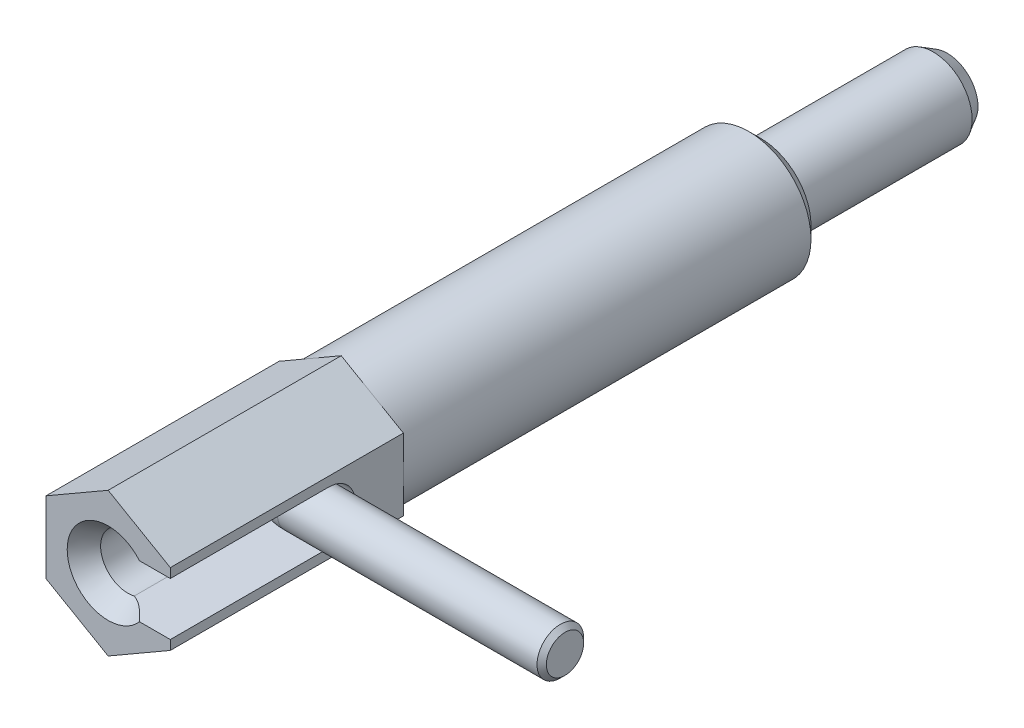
ISO-10303-21;
HEADER;
FILE_DESCRIPTION(('STEP AP214'),'2;1');
FILE_NAME('part.step','',(''),(''),'','','');
FILE_SCHEMA(('AUTOMOTIVE_DESIGN { 1 0 10303 214 1 1 1 1 }'));
ENDSEC;
DATA;
#1=APPLICATION_CONTEXT('core data for automotive mechanical design processes');
#2=APPLICATION_PROTOCOL_DEFINITION('international standard','automotive_design',2000,#1);
#3=PRODUCT_CONTEXT('',#1,'mechanical');
#4=PRODUCT('Part','Part','',(#3));
#5=PRODUCT_RELATED_PRODUCT_CATEGORY('part','',(#4));
#6=PRODUCT_DEFINITION_FORMATION('','',#4);
#7=PRODUCT_DEFINITION_CONTEXT('part definition',#1,'design');
#8=PRODUCT_DEFINITION('design','',#6,#7);
#9=PRODUCT_DEFINITION_SHAPE('','',#8);
#10=(LENGTH_UNIT() NAMED_UNIT(*) SI_UNIT(.MILLI.,.METRE.));
#11=(NAMED_UNIT(*) PLANE_ANGLE_UNIT() SI_UNIT($,.RADIAN.));
#12=(NAMED_UNIT(*) SI_UNIT($,.STERADIAN.) SOLID_ANGLE_UNIT());
#13=UNCERTAINTY_MEASURE_WITH_UNIT(LENGTH_MEASURE(1.E-05),#10,'distance_accuracy_value','');
#14=(GEOMETRIC_REPRESENTATION_CONTEXT(3) GLOBAL_UNCERTAINTY_ASSIGNED_CONTEXT((#13)) GLOBAL_UNIT_ASSIGNED_CONTEXT((#10,
#11,#12)) REPRESENTATION_CONTEXT('',''));
#15=CARTESIAN_POINT('',(0.,0.,0.));
#16=DIRECTION('',(0.,0.,1.));
#17=DIRECTION('',(1.,0.,0.));
#18=AXIS2_PLACEMENT_3D('',#15,#16,#17);
#19=CARTESIAN_POINT('',(19.2,0.,31.8));
#20=DIRECTION('',(-1.,0.,0.));
#21=DIRECTION('',(0.,0.,1.));
#22=AXIS2_PLACEMENT_3D('',#19,#20,#21);
#23=PLANE('',#22);
#24=CARTESIAN_POINT('',(19.2000000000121,0.,31.8));
#25=DIRECTION('',(-1.,0.,0.));
#26=DIRECTION('',(0.,0.,1.));
#27=AXIS2_PLACEMENT_3D('',#24,#25,#26);
#28=CIRCLE('',#27,1.19999999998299);
#29=CARTESIAN_POINT('',(19.2000000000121,0.,32.999999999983));
#30=VERTEX_POINT('',#29);
#31=EDGE_CURVE('E352',#30,#30,#28,.T.);
#32=ORIENTED_EDGE('',*,*,#31,.F.);
#33=EDGE_LOOP('',(#32));
#34=FACE_BOUND('',#33,.T.);
#35=ADVANCED_FACE('F14',(#34),#23,.F.);
#36=CARTESIAN_POINT('',(18.8999999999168,0.,31.8));
#37=DIRECTION('',(-1.,0.,0.));
#38=DIRECTION('',(0.,0.,1.));
#39=AXIS2_PLACEMENT_3D('',#36,#37,#38);
#40=CONICAL_SURFACE('',#39,1.50000000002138,0.78539816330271);
#41=ORIENTED_EDGE('',*,*,#31,.T.);
#42=EDGE_LOOP('',(#41));
#43=FACE_BOUND('',#42,.T.);
#44=CARTESIAN_POINT('',(18.9,0.,31.8));
#45=DIRECTION('',(1.,0.,0.));
#46=DIRECTION('',(0.,0.,-1.));
#47=AXIS2_PLACEMENT_3D('',#44,#45,#46);
#48=CIRCLE('',#47,1.5);
#49=CARTESIAN_POINT('',(18.9,0.,30.3));
#50=VERTEX_POINT('',#49);
#51=EDGE_CURVE('E342',#50,#50,#48,.F.);
#52=ORIENTED_EDGE('',*,*,#51,.F.);
#53=EDGE_LOOP('',(#52));
#54=FACE_BOUND('',#53,.T.);
#55=ADVANCED_FACE('F496',(#43,#54),#40,.T.);
#56=CARTESIAN_POINT('',(2.2,0.,31.8));
#57=DIRECTION('',(1.,0.,0.));
#58=DIRECTION('',(0.,0.,-1.));
#59=AXIS2_PLACEMENT_3D('',#56,#57,#58);
#60=CYLINDRICAL_SURFACE('',#59,1.5);
#61=ORIENTED_EDGE('',*,*,#51,.T.);
#62=EDGE_LOOP('',(#61));
#63=FACE_BOUND('',#62,.T.);
#64=CARTESIAN_POINT('',(2.2,0.,31.8));
#65=DIRECTION('',(-1.,0.,0.));
#66=DIRECTION('',(0.,0.,1.));
#67=AXIS2_PLACEMENT_3D('',#64,#65,#66);
#68=CIRCLE('',#67,1.5);
#69=CARTESIAN_POINT('',(2.2,0.,33.3));
#70=VERTEX_POINT('',#69);
#71=EDGE_CURVE('E339',#70,#70,#68,.T.);
#72=ORIENTED_EDGE('',*,*,#71,.F.);
#73=EDGE_LOOP('',(#72));
#74=FACE_BOUND('',#73,.T.);
#75=ADVANCED_FACE('F332',(#63,#74),#60,.T.);
#76=CARTESIAN_POINT('',(2.2,0.,29.6));
#77=DIRECTION('',(0.,-1.,0.));
#78=DIRECTION('',(-1.,0.,0.));
#79=AXIS2_PLACEMENT_3D('',#76,#77,#78);
#80=TOROIDAL_SURFACE('',#79,2.2,1.5);
#81=CARTESIAN_POINT('',(1.75,0.,33.2725331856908));
#82=CARTESIAN_POINT('',(1.74999438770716,-0.066525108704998,33.2725276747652));
#83=CARTESIAN_POINT('',(1.74616774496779,-0.1331198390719,33.2675728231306));
#84=CARTESIAN_POINT('',(1.73122032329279,-0.264085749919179,33.2480674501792));
#85=CARTESIAN_POINT('',(1.72008775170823,-0.328453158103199,33.2335014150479));
#86=CARTESIAN_POINT('',(1.69163334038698,-0.452673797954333,33.1957821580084));
#87=CARTESIAN_POINT('',(1.67435024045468,-0.512552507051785,33.1726826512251));
#88=CARTESIAN_POINT('',(1.63491483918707,-0.627081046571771,33.1190379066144));
#89=CARTESIAN_POINT('',(1.61276146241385,-0.681729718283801,33.0884910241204));
#90=CARTESIAN_POINT('',(1.55609957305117,-0.804461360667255,33.0085910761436));
#91=CARTESIAN_POINT('',(1.52005360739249,-0.870025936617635,32.9564626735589));
#92=CARTESIAN_POINT('',(1.44463855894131,-0.990242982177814,32.8428485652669));
#93=CARTESIAN_POINT('',(1.4052625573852,-1.0448718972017,32.7813431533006));
#94=CARTESIAN_POINT('',(1.31304970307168,-1.15994213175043,32.6295788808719));
#95=CARTESIAN_POINT('',(1.26001104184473,-1.21646839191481,32.5364845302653));
#96=CARTESIAN_POINT('',(1.15856030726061,-1.31345505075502,32.3399230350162));
#97=CARTESIAN_POINT('',(1.11015386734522,-1.35389607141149,32.2364435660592));
#98=CARTESIAN_POINT('',(1.03239391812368,-1.41370400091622,32.0423606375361));
#99=CARTESIAN_POINT('',(1.0011658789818,-1.43566447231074,31.9533002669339));
#100=CARTESIAN_POINT('',(0.94925549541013,-1.47051108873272,31.770470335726));
#101=CARTESIAN_POINT('',(0.928544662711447,-1.48342178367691,31.6767142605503));
#102=CARTESIAN_POINT('',(0.907447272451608,-1.49637158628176,31.5202437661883));
#103=CARTESIAN_POINT('',(0.902442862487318,-1.49936149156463,31.4584073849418));
#104=CARTESIAN_POINT('',(0.900637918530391,-1.50045511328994,31.3345051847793));
#105=CARTESIAN_POINT('',(0.903826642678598,-1.49856522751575,31.2724397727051));
#106=CARTESIAN_POINT('',(0.915762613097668,-1.49127254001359,31.1802465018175));
#107=CARTESIAN_POINT('',(0.920993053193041,-1.48806182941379,31.1494632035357));
#108=CARTESIAN_POINT('',(0.933926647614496,-1.47998010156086,31.0886496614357));
#109=CARTESIAN_POINT('',(0.941628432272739,-1.47511000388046,31.0586190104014));
#110=CARTESIAN_POINT('',(0.959439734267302,-1.46358695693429,30.999651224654));
#111=CARTESIAN_POINT('',(0.969547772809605,-1.4569351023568,30.9707134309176));
#112=CARTESIAN_POINT('',(0.991965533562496,-1.44176556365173,30.9142234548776));
#113=CARTESIAN_POINT('',(1.00427506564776,-1.43324804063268,30.8866711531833));
#114=CARTESIAN_POINT('',(1.04000568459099,-1.4077096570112,30.8146080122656));
#115=CARTESIAN_POINT('',(1.06521040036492,-1.38888931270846,30.7715948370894));
#116=CARTESIAN_POINT('',(1.11908741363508,-1.34585803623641,30.690776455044));
#117=CARTESIAN_POINT('',(1.14776380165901,-1.32164071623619,30.6529775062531));
#118=CARTESIAN_POINT('',(1.21802499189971,-1.25775266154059,30.5687007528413));
#119=CARTESIAN_POINT('',(1.26029032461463,-1.21573567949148,30.5245699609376));
#120=CARTESIAN_POINT('',(1.34343795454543,-1.12319551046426,30.4447555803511));
#121=CARTESIAN_POINT('',(1.38431813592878,-1.07265995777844,30.4090844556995));
#122=CARTESIAN_POINT('',(1.46264058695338,-0.96322508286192,30.3442707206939));
#123=CARTESIAN_POINT('',(1.49999592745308,-0.904176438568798,30.3152757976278));
#124=CARTESIAN_POINT('',(1.56825139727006,-0.779824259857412,30.263930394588));
#125=CARTESIAN_POINT('',(1.59915233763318,-0.714521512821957,30.2415790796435));
#126=CARTESIAN_POINT('',(1.65670933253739,-0.56979148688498,30.2005849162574));
#127=CARTESIAN_POINT('',(1.68222871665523,-0.48964766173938,30.1828504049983));
#128=CARTESIAN_POINT('',(1.72159904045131,-0.325187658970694,30.1556319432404));
#129=CARTESIAN_POINT('',(1.73545037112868,-0.240871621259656,30.1461477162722));
#130=CARTESIAN_POINT('',(1.75047446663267,-0.072708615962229,30.1358638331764));
#131=CARTESIAN_POINT('',(1.75195350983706,0.011098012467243,30.1348543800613));
#132=CARTESIAN_POINT('',(1.74294808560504,0.17774805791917,30.1410133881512));
#133=CARTESIAN_POINT('',(1.73246509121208,0.260591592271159,30.1481808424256));
#134=CARTESIAN_POINT('',(1.70053172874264,0.420977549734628,30.1701719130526));
#135=CARTESIAN_POINT('',(1.67934748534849,0.49859911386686,30.1848098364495));
#136=CARTESIAN_POINT('',(1.62726592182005,0.64870545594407,30.2214493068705));
#137=CARTESIAN_POINT('',(1.59636337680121,0.721187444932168,30.2434548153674));
#138=CARTESIAN_POINT('',(1.52513682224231,0.861925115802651,30.2960527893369));
#139=CARTESIAN_POINT('',(1.48449295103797,0.929906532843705,30.3269461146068));
#140=CARTESIAN_POINT('',(1.39715751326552,1.05657040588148,30.3979573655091));
#141=CARTESIAN_POINT('',(1.3504690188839,1.11525755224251,30.4380706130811));
#142=CARTESIAN_POINT('',(1.26670549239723,1.20867926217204,30.518364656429));
#143=CARTESIAN_POINT('',(1.2300221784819,1.24577884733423,30.5562041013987));
#144=CARTESIAN_POINT('',(1.15831969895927,1.31270178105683,30.6391638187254));
#145=CARTESIAN_POINT('',(1.12329727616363,1.3425398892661,30.684269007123));
#146=CARTESIAN_POINT('',(1.06377512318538,1.38999694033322,30.7739145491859));
#147=CARTESIAN_POINT('',(1.03849498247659,1.40882459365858,30.8172895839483));
#148=CARTESIAN_POINT('',(0.993526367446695,1.44089280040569,30.9087405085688));
#149=CARTESIAN_POINT('',(0.973833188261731,1.45413805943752,30.9568123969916));
#150=CARTESIAN_POINT('',(0.941404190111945,1.4753441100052,31.0563208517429));
#151=CARTESIAN_POINT('',(0.928666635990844,1.48330621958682,31.1077565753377));
#152=CARTESIAN_POINT('',(0.910379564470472,1.49459724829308,31.2123887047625));
#153=CARTESIAN_POINT('',(0.904838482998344,1.4979207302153,31.2655871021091));
#154=CARTESIAN_POINT('',(0.899448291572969,1.50117184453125,31.3929536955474));
#155=CARTESIAN_POINT('',(0.902624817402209,1.49929173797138,31.467283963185));
#156=CARTESIAN_POINT('',(0.918823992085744,1.48940766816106,31.6144725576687));
#157=CARTESIAN_POINT('',(0.931873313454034,1.48138711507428,31.6873263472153));
#158=CARTESIAN_POINT('',(0.961293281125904,1.46241026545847,31.8135619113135));
#159=CARTESIAN_POINT('',(0.976156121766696,1.45259151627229,31.8674858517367));
#160=CARTESIAN_POINT('',(1.00921308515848,1.42982224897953,31.9736378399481));
#161=CARTESIAN_POINT('',(1.02740887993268,1.4168701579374,32.0258650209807));
#162=CARTESIAN_POINT('',(1.08585641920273,1.37323789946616,32.1798662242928));
#163=CARTESIAN_POINT('',(1.12994642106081,1.33779424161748,32.2788760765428));
#164=CARTESIAN_POINT('',(1.22511394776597,1.2513556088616,32.4717724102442));
#165=CARTESIAN_POINT('',(1.2763937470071,1.19981939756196,32.5653197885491));
#166=CARTESIAN_POINT('',(1.35353396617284,1.10995382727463,32.6966096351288));
#167=CARTESIAN_POINT('',(1.37925333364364,1.07795069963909,32.738822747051));
#168=CARTESIAN_POINT('',(1.43013765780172,1.00946930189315,32.8199420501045));
#169=CARTESIAN_POINT('',(1.45530195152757,0.972985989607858,32.8588444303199));
#170=CARTESIAN_POINT('',(1.51199498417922,0.883181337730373,32.9444044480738));
#171=CARTESIAN_POINT('',(1.54303425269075,0.828174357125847,32.9896495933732));
#172=CARTESIAN_POINT('',(1.60071320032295,0.710283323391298,33.07178527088));
#173=CARTESIAN_POINT('',(1.62736260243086,0.647417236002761,33.1086943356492));
#174=CARTESIAN_POINT('',(1.67050699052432,0.524834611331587,33.1675040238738));
#175=CARTESIAN_POINT('',(1.6879358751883,0.466142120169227,33.1908446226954));
#176=CARTESIAN_POINT('',(1.71683271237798,0.344753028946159,33.2292153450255));
#177=CARTESIAN_POINT('',(1.72831245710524,0.282064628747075,33.2442619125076));
#178=CARTESIAN_POINT('',(1.74084964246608,0.182366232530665,33.260637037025));
#179=CARTESIAN_POINT('',(1.74426968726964,0.14613191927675,33.2650874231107));
#180=CARTESIAN_POINT('',(1.74884666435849,0.0732721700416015,33.271037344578));
#181=CARTESIAN_POINT('',(1.75000309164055,0.03664664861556,33.2725362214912));
#182=CARTESIAN_POINT('',(1.75,0.,33.2725331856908));
#183=B_SPLINE_CURVE_WITH_KNOTS('',3,(#81,#82,#83,#84,#85,#86,#87,#88,#89,#90,#91,#92,#93,#94,
#95,#96,#97,#98,#99,#100,#101,#102,#103,#104,#105,#106,#107,#108,#109,#110,#111,#112,#113,#114,
#115,#116,#117,#118,#119,#120,#121,#122,#123,#124,#125,#126,#127,#128,#129,#130,#131,#132,#133,
#134,#135,#136,#137,#138,#139,#140,#141,#142,#143,#144,#145,#146,#147,#148,#149,#150,#151,#152,
#153,#154,#155,#156,#157,#158,#159,#160,#161,#162,#163,#164,#165,#166,#167,#168,#169,#170,#171,
#172,#173,#174,#175,#176,#177,#178,#179,#180,#181,#182),.UNSPECIFIED.,.T.,.F.,(4,2,2,2,2,2,2,2,
2,2,2,2,2,2,2,2,2,2,2,2,2,2,2,2,2,2,2,2,2,2,2,2,2,2,2,2,2,2,2,2,2,2,2,2,2,2,2,2,2,2,4),(0.,
0.199414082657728,0.399150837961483,0.597651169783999,0.796195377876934,1.06825738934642,
1.34089924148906,1.702460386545,2.06445579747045,2.35431799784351,2.64339079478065,
2.82917777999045,3.01472130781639,3.10876120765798,3.20274907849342,3.2966793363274,
3.39060148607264,3.54969108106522,3.7089699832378,3.93023382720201,4.15182167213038,
4.37792049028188,4.60399088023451,4.86058869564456,5.1171779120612,5.36739581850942,
5.61758291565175,5.86183381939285,6.10621626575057,6.36010967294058,6.61387454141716,
6.80654417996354,6.99881886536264,7.15896104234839,7.31896795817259,7.47893494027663,
7.63908927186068,7.86111032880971,8.08373335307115,8.25388363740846,8.42411951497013,
8.76485080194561,9.11856876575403,9.29500756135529,9.47164677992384,9.70387786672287,
9.93558746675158,10.1313555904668,10.3267341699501,10.4365607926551,10.5464119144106),.UNSPECIFIED.);
#184=CARTESIAN_POINT('',(1.00617152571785,-1.43182361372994,30.8835496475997));
#185=VERTEX_POINT('',#184);
#186=CARTESIAN_POINT('',(1.6428928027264,-0.602829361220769,30.210472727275));
#187=VERTEX_POINT('',#186);
#188=EDGE_CURVE('E9',#185,#187,#183,.T.);
#189=ORIENTED_EDGE('',*,*,#188,.F.);
#190=CARTESIAN_POINT('',(0.393823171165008,1.49772263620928,30.9957444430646));
#191=CARTESIAN_POINT('',(0.421472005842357,1.49885509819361,30.9978571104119));
#192=CARTESIAN_POINT('',(0.449193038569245,1.49958407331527,30.9992207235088));
#193=CARTESIAN_POINT('',(0.504711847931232,1.50015047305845,31.000281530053));
#194=CARTESIAN_POINT('',(0.532509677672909,1.49998667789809,30.9999764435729));
#195=CARTESIAN_POINT('',(0.616053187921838,1.4980198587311,30.9962879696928));
#196=CARTESIAN_POINT('',(0.671697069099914,1.49472957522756,30.9901091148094));
#197=CARTESIAN_POINT('',(0.781392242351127,1.48324331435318,30.9692575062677));
#198=CARTESIAN_POINT('',(0.835426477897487,1.47500683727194,30.9545146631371));
#199=CARTESIAN_POINT('',(0.939055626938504,1.45274692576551,30.9168273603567));
#200=CARTESIAN_POINT('',(0.988667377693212,1.43874668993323,30.8939158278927));
#201=CARTESIAN_POINT('',(1.07717022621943,1.40636298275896,30.8445353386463));
#202=CARTESIAN_POINT('',(1.11663981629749,1.38858956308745,30.818687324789));
#203=CARTESIAN_POINT('',(1.19066124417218,1.34815475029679,30.7638313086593));
#204=CARTESIAN_POINT('',(1.22520109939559,1.32548177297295,30.7348158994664));
#205=CARTESIAN_POINT('',(1.30360414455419,1.26463395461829,30.6625552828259));
#206=CARTESIAN_POINT('',(1.34494303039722,1.22401516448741,30.6186340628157));
#207=CARTESIAN_POINT('',(1.41940355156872,1.13447269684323,30.5323792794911));
#208=CARTESIAN_POINT('',(1.45251508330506,1.08553893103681,30.4900477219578));
#209=CARTESIAN_POINT('',(1.51263424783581,0.979340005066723,30.4087899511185));
#210=CARTESIAN_POINT('',(1.5394849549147,0.921909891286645,30.36996376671));
#211=CARTESIAN_POINT('',(1.58704795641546,0.800851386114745,30.2988087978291));
#212=CARTESIAN_POINT('',(1.6077608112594,0.73722356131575,30.2664794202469));
#213=CARTESIAN_POINT('',(1.6461265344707,0.595349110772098,30.2055245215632));
#214=CARTESIAN_POINT('',(1.66288954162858,0.516325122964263,30.1781311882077));
#215=CARTESIAN_POINT('',(1.68902171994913,0.353947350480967,30.1351338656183));
#216=CARTESIAN_POINT('',(1.69839003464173,0.270593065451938,30.1195312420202));
#217=CARTESIAN_POINT('',(1.70947134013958,0.103035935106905,30.1010600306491));
#218=CARTESIAN_POINT('',(1.71127852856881,0.0188567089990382,30.0980347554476));
#219=CARTESIAN_POINT('',(1.70743701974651,-0.148839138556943,30.1044506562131));
#220=CARTESIAN_POINT('',(1.70178939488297,-0.232355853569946,30.1138900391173));
#221=CARTESIAN_POINT('',(1.68338951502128,-0.394603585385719,30.1444149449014));
#222=CARTESIAN_POINT('',(1.67078597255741,-0.473397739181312,30.1652566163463));
#223=CARTESIAN_POINT('',(1.63868368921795,-0.625977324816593,30.2173880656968));
#224=CARTESIAN_POINT('',(1.61918184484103,-0.699760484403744,30.2486825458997));
#225=CARTESIAN_POINT('',(1.57232480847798,-0.842463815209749,30.3212104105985));
#226=CARTESIAN_POINT('',(1.54476412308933,-0.911188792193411,30.3626986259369));
#227=CARTESIAN_POINT('',(1.49692912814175,-1.00735362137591,30.4300426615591));
#228=CARTESIAN_POINT('',(1.47989488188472,-1.03826415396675,30.4533514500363));
#229=CARTESIAN_POINT('',(1.44341187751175,-1.09757082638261,30.5012356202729));
#230=CARTESIAN_POINT('',(1.42396379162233,-1.12596766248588,30.5258106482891));
#231=CARTESIAN_POINT('',(1.37155994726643,-1.19406466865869,30.5886699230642));
#232=CARTESIAN_POINT('',(1.3368322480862,-1.23198230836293,30.6274497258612));
#233=CARTESIAN_POINT('',(1.26003509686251,-1.30060164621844,30.7040664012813));
#234=CARTESIAN_POINT('',(1.217979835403,-1.33131702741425,30.7419049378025));
#235=CARTESIAN_POINT('',(1.13472128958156,-1.37968774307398,30.8061390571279));
#236=CARTESIAN_POINT('',(1.09494283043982,-1.3987212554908,30.8333289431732));
#237=CARTESIAN_POINT('',(1.01042598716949,-1.43153662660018,30.882622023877));
#238=CARTESIAN_POINT('',(0.965696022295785,-1.44532722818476,30.9047336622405));
#239=CARTESIAN_POINT('',(0.872316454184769,-1.4679332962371,30.9422935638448));
#240=CARTESIAN_POINT('',(0.823664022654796,-1.47674513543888,30.9577369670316));
#241=CARTESIAN_POINT('',(0.723954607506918,-1.49001244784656,30.9814349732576));
#242=CARTESIAN_POINT('',(0.672891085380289,-1.49445526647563,30.9896686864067));
#243=CARTESIAN_POINT('',(0.583548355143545,-1.49899859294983,30.9981160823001));
#244=CARTESIAN_POINT('',(0.545434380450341,-1.49993318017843,30.9998683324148));
#245=CARTESIAN_POINT('',(0.469430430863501,-1.50005883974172,31.0001165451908));
#246=CARTESIAN_POINT('',(0.431540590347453,-1.49926107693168,30.9986333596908));
#247=CARTESIAN_POINT('',(0.393823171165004,-1.49772263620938,30.9957444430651));
#248=B_SPLINE_CURVE_WITH_KNOTS('',3,(#190,#191,#192,#193,#194,#195,#196,#197,#198,#199,#200,
#201,#202,#203,#204,#205,#206,#207,#208,#209,#210,#211,#212,#213,#214,#215,#216,#217,#218,#219,
#220,#221,#222,#223,#224,#225,#226,#227,#228,#229,#230,#231,#232,#233,#234,#235,#236,#237,#238,
#239,#240,#241,#242,#243,#244,#245,#246,#247),.UNSPECIFIED.,.F.,.F.,(4,2,2,2,2,2,2,2,2,2,2,2,2,
2,2,2,2,2,2,2,2,2,2,2,2,2,2,2,4),(0.,0.0832344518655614,0.166582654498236,0.334031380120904,
0.50287024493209,0.671036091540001,0.821648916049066,0.972621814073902,1.18958838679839,
1.40682010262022,1.62902022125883,1.8512000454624,2.10585684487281,2.36054313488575,
2.61204688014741,2.86351445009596,3.10980314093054,3.35620277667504,3.60953401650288,
3.73628614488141,3.86300305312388,4.0554857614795,4.24759976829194,4.40235288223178,
4.55684679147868,4.71145311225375,4.86650593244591,4.9808295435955,5.09441853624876),.UNSPECIFIED.);
#249=EDGE_CURVE('E313',#187,#185,#248,.T.);
#250=ORIENTED_EDGE('',*,*,#249,.F.);
#251=EDGE_LOOP('',(#189,#250));
#252=FACE_BOUND('',#251,.T.);
#253=CARTESIAN_POINT('',(0.,0.,29.6));
#254=DIRECTION('',(0.,0.,1.));
#255=DIRECTION('',(1.,0.,0.));
#256=AXIS2_PLACEMENT_3D('',#253,#254,#255);
#257=CIRCLE('',#256,1.5);
#258=CARTESIAN_POINT('',(1.49999999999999,0.,29.6));
#259=VERTEX_POINT('',#258);
#260=EDGE_CURVE('E249',#259,#259,#257,.F.);
#261=ORIENTED_EDGE('',*,*,#260,.F.);
#262=EDGE_LOOP('',(#261));
#263=FACE_BOUND('',#262,.T.);
#264=ORIENTED_EDGE('',*,*,#71,.T.);
#265=EDGE_LOOP('',(#264));
#266=FACE_BOUND('',#265,.T.);
#267=CARTESIAN_POINT('',(1.64289280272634,0.602829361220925,30.2104727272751));
#268=VERTEX_POINT('',#267);
#269=CARTESIAN_POINT('',(1.0061715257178,1.43182361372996,30.8835496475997));
#270=VERTEX_POINT('',#269);
#271=EDGE_CURVE('E27',#268,#270,#183,.T.);
#272=ORIENTED_EDGE('',*,*,#271,.F.);
#273=EDGE_CURVE('E321',#270,#268,#248,.T.);
#274=ORIENTED_EDGE('',*,*,#273,.F.);
#275=EDGE_LOOP('',(#272,#274));
#276=FACE_BOUND('',#275,.T.);
#277=ADVANCED_FACE('F325',(#252,#263,#266,#276),#80,.T.);
#278=CARTESIAN_POINT('',(0.,0.,-12.));
#279=DIRECTION('',(0.,0.,1.));
#280=DIRECTION('',(1.,0.,0.));
#281=AXIS2_PLACEMENT_3D('',#278,#279,#280);
#282=CYLINDRICAL_SURFACE('',#281,1.5);
#283=ORIENTED_EDGE('',*,*,#260,.T.);
#284=EDGE_LOOP('',(#283));
#285=FACE_BOUND('',#284,.T.);
#286=CARTESIAN_POINT('',(0.,0.,27.));
#287=DIRECTION('',(0.,0.,-1.));
#288=DIRECTION('',(-1.,0.,0.));
#289=AXIS2_PLACEMENT_3D('',#286,#287,#288);
#290=CIRCLE('',#289,1.5);
#291=CARTESIAN_POINT('',(-1.50000000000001,0.,27.));
#292=VERTEX_POINT('',#291);
#293=EDGE_CURVE('E653',#292,#292,#290,.T.);
#294=ORIENTED_EDGE('',*,*,#293,.F.);
#295=EDGE_LOOP('',(#294));
#296=FACE_BOUND('',#295,.T.);
#297=ADVANCED_FACE('F331',(#285,#296),#282,.T.);
#298=CARTESIAN_POINT('',(0.,-4.61880215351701,42.));
#299=DIRECTION('',(-0.5,-0.866025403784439,0.));
#300=DIRECTION('',(-0.866025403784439,0.5,0.));
#301=AXIS2_PLACEMENT_3D('',#298,#299,#300);
#302=PLANE('',#301);
#303=DIRECTION('',(0.,0.,1.));
#304=VECTOR('',#303,1.);
#305=CARTESIAN_POINT('',(-4.,-2.3094010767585,42.));
#306=LINE('',#305,#304);
#307=CARTESIAN_POINT('',(-4.,-2.3094010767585,27.));
#308=VERTEX_POINT('',#307);
#309=CARTESIAN_POINT('',(-4.,-2.3094010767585,42.));
#310=VERTEX_POINT('',#309);
#311=EDGE_CURVE('E191',#308,#310,#306,.T.);
#312=ORIENTED_EDGE('',*,*,#311,.F.);
#313=DIRECTION('',(-0.866025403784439,0.5,0.));
#314=VECTOR('',#313,1.);
#315=CARTESIAN_POINT('',(-2.,-3.46410161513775,27.));
#316=LINE('',#315,#314);
#317=CARTESIAN_POINT('',(-2.,-3.46410161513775,27.));
#318=VERTEX_POINT('',#317);
#319=EDGE_CURVE('E143',#318,#308,#316,.T.);
#320=ORIENTED_EDGE('',*,*,#319,.F.);
#321=DIRECTION('',(-0.866025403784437,0.5,0.));
#322=VECTOR('',#321,1.);
#323=CARTESIAN_POINT('',(0.,-4.61880215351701,27.));
#324=LINE('',#323,#322);
#325=CARTESIAN_POINT('',(0.,-4.61880215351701,27.));
#326=VERTEX_POINT('',#325);
#327=EDGE_CURVE('E172',#326,#318,#324,.T.);
#328=ORIENTED_EDGE('',*,*,#327,.F.);
#329=DIRECTION('',(0.,0.,-1.));
#330=VECTOR('',#329,1.);
#331=CARTESIAN_POINT('',(0.,-4.61880215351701,42.));
#332=LINE('',#331,#330);
#333=CARTESIAN_POINT('',(0.,-4.61880215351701,42.));
#334=VERTEX_POINT('',#333);
#335=EDGE_CURVE('E194',#326,#334,#332,.F.);
#336=ORIENTED_EDGE('',*,*,#335,.T.);
#337=DIRECTION('',(-0.866025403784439,0.5,0.));
#338=VECTOR('',#337,1.);
#339=CARTESIAN_POINT('',(0.,-4.61880215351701,42.));
#340=LINE('',#339,#338);
#341=EDGE_CURVE('E197',#334,#310,#340,.T.);
#342=ORIENTED_EDGE('',*,*,#341,.T.);
#343=EDGE_LOOP('',(#312,#320,#328,#336,#342));
#344=FACE_BOUND('',#343,.T.);
#345=ADVANCED_FACE('F375',(#344),#302,.T.);
#346=CARTESIAN_POINT('',(-4.,-2.3094010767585,42.));
#347=DIRECTION('',(-1.,0.,0.));
#348=DIRECTION('',(0.,0.,1.));
#349=AXIS2_PLACEMENT_3D('',#346,#347,#348);
#350=PLANE('',#349);
#351=DIRECTION('',(0.,0.,1.));
#352=VECTOR('',#351,1.);
#353=CARTESIAN_POINT('',(-4.,2.3094010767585,42.));
#354=LINE('',#353,#352);
#355=CARTESIAN_POINT('',(-4.,2.3094010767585,42.));
#356=VERTEX_POINT('',#355);
#357=CARTESIAN_POINT('',(-4.,2.3094010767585,27.));
#358=VERTEX_POINT('',#357);
#359=EDGE_CURVE('E133',#356,#358,#354,.F.);
#360=ORIENTED_EDGE('',*,*,#359,.T.);
#361=DIRECTION('',(0.,1.,0.));
#362=VECTOR('',#361,1.);
#363=CARTESIAN_POINT('',(-4.,0.,27.));
#364=LINE('',#363,#362);
#365=CARTESIAN_POINT('',(-4.,0.,27.));
#366=VERTEX_POINT('',#365);
#367=EDGE_CURVE('E142',#366,#358,#364,.T.);
#368=ORIENTED_EDGE('',*,*,#367,.F.);
#369=DIRECTION('',(0.,1.,0.));
#370=VECTOR('',#369,1.);
#371=CARTESIAN_POINT('',(-4.,0.,27.));
#372=LINE('',#371,#370);
#373=EDGE_CURVE('E167',#308,#366,#372,.T.);
#374=ORIENTED_EDGE('',*,*,#373,.F.);
#375=ORIENTED_EDGE('',*,*,#311,.T.);
#376=DIRECTION('',(0.,1.,0.));
#377=VECTOR('',#376,1.);
#378=CARTESIAN_POINT('',(-4.,-2.3094010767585,42.));
#379=LINE('',#378,#377);
#380=EDGE_CURVE('E151',#310,#356,#379,.T.);
#381=ORIENTED_EDGE('',*,*,#380,.T.);
#382=EDGE_LOOP('',(#360,#368,#374,#375,#381));
#383=FACE_BOUND('',#382,.T.);
#384=ADVANCED_FACE('F146',(#383),#350,.T.);
#385=CARTESIAN_POINT('',(-4.,2.3094010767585,42.));
#386=DIRECTION('',(-0.5,0.866025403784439,0.));
#387=DIRECTION('',(0.866025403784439,0.5,0.));
#388=AXIS2_PLACEMENT_3D('',#385,#386,#387);
#389=PLANE('',#388);
#390=DIRECTION('',(0.,0.,-1.));
#391=VECTOR('',#390,1.);
#392=CARTESIAN_POINT('',(0.,4.61880215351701,42.));
#393=LINE('',#392,#391);
#394=CARTESIAN_POINT('',(0.,4.61880215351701,42.));
#395=VERTEX_POINT('',#394);
#396=CARTESIAN_POINT('',(0.,4.61880215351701,27.));
#397=VERTEX_POINT('',#396);
#398=EDGE_CURVE('E193',#395,#397,#393,.T.);
#399=ORIENTED_EDGE('',*,*,#398,.T.);
#400=DIRECTION('',(0.866025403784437,0.5,0.));
#401=VECTOR('',#400,1.);
#402=CARTESIAN_POINT('',(-2.,3.46410161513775,27.));
#403=LINE('',#402,#401);
#404=CARTESIAN_POINT('',(-2.,3.46410161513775,27.));
#405=VERTEX_POINT('',#404);
#406=EDGE_CURVE('E136',#405,#397,#403,.T.);
#407=ORIENTED_EDGE('',*,*,#406,.F.);
#408=DIRECTION('',(0.866025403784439,0.5,0.));
#409=VECTOR('',#408,1.);
#410=CARTESIAN_POINT('',(-4.,2.3094010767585,27.));
#411=LINE('',#410,#409);
#412=EDGE_CURVE('E128',#358,#405,#411,.T.);
#413=ORIENTED_EDGE('',*,*,#412,.F.);
#414=ORIENTED_EDGE('',*,*,#359,.F.);
#415=DIRECTION('',(0.866025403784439,0.5,0.));
#416=VECTOR('',#415,1.);
#417=CARTESIAN_POINT('',(-4.,2.3094010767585,42.));
#418=LINE('',#417,#416);
#419=EDGE_CURVE('E215',#356,#395,#418,.T.);
#420=ORIENTED_EDGE('',*,*,#419,.T.);
#421=EDGE_LOOP('',(#399,#407,#413,#414,#420));
#422=FACE_BOUND('',#421,.T.);
#423=ADVANCED_FACE('F131',(#422),#389,.T.);
#424=CARTESIAN_POINT('',(0.,0.,27.));
#425=DIRECTION('',(0.,0.,-1.));
#426=DIRECTION('',(-1.,0.,0.));
#427=AXIS2_PLACEMENT_3D('',#424,#425,#426);
#428=PLANE('',#427);
#429=CARTESIAN_POINT('',(0.,0.,27.));
#430=DIRECTION('',(0.,0.,1.));
#431=DIRECTION('',(1.,0.,0.));
#432=AXIS2_PLACEMENT_3D('',#429,#430,#431);
#433=CIRCLE('',#432,4.);
#434=CARTESIAN_POINT('',(2.,-3.46410161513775,27.));
#435=VERTEX_POINT('',#434);
#436=EDGE_CURVE('E254',#435,#318,#433,.F.);
#437=ORIENTED_EDGE('',*,*,#436,.F.);
#438=DIRECTION('',(-0.866025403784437,-0.5,0.));
#439=VECTOR('',#438,1.);
#440=CARTESIAN_POINT('',(2.,-3.46410161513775,27.));
#441=LINE('',#440,#439);
#442=EDGE_CURVE('E169',#435,#326,#441,.T.);
#443=ORIENTED_EDGE('',*,*,#442,.T.);
#444=ORIENTED_EDGE('',*,*,#327,.T.);
#445=EDGE_LOOP('',(#437,#443,#444));
#446=FACE_BOUND('',#445,.T.);
#447=ADVANCED_FACE('F397',(#446),#428,.T.);
#448=CARTESIAN_POINT('',(0.,4.61880215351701,42.));
#449=DIRECTION('',(0.5,0.866025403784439,0.));
#450=DIRECTION('',(0.866025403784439,-0.5,0.));
#451=AXIS2_PLACEMENT_3D('',#448,#449,#450);
#452=PLANE('',#451);
#453=DIRECTION('',(0.,0.,-1.));
#454=VECTOR('',#453,1.);
#455=CARTESIAN_POINT('',(4.,2.3094010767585,42.));
#456=LINE('',#455,#454);
#457=CARTESIAN_POINT('',(4.,2.3094010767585,27.));
#458=VERTEX_POINT('',#457);
#459=CARTESIAN_POINT('',(4.,2.3094010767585,42.));
#460=VERTEX_POINT('',#459);
#461=EDGE_CURVE('E211',#458,#460,#456,.F.);
#462=ORIENTED_EDGE('',*,*,#461,.F.);
#463=DIRECTION('',(0.866025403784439,-0.5,0.));
#464=VECTOR('',#463,1.);
#465=CARTESIAN_POINT('',(2.,3.46410161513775,27.));
#466=LINE('',#465,#464);
#467=CARTESIAN_POINT('',(2.,3.46410161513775,27.));
#468=VERTEX_POINT('',#467);
#469=EDGE_CURVE('E181',#468,#458,#466,.T.);
#470=ORIENTED_EDGE('',*,*,#469,.F.);
#471=DIRECTION('',(0.866025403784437,-0.5,0.));
#472=VECTOR('',#471,1.);
#473=CARTESIAN_POINT('',(0.,4.61880215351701,27.));
#474=LINE('',#473,#472);
#475=EDGE_CURVE('E188',#397,#468,#474,.T.);
#476=ORIENTED_EDGE('',*,*,#475,.F.);
#477=ORIENTED_EDGE('',*,*,#398,.F.);
#478=DIRECTION('',(0.866025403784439,-0.5,0.));
#479=VECTOR('',#478,1.);
#480=CARTESIAN_POINT('',(0.,4.61880215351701,42.));
#481=LINE('',#480,#479);
#482=EDGE_CURVE('E220',#395,#460,#481,.T.);
#483=ORIENTED_EDGE('',*,*,#482,.T.);
#484=EDGE_LOOP('',(#462,#470,#476,#477,#483));
#485=FACE_BOUND('',#484,.T.);
#486=ADVANCED_FACE('F394',(#485),#452,.T.);
#487=CARTESIAN_POINT('',(0.,0.,27.));
#488=DIRECTION('',(0.,0.,-1.));
#489=DIRECTION('',(-1.,0.,0.));
#490=AXIS2_PLACEMENT_3D('',#487,#488,#489);
#491=PLANE('',#490);
#492=CARTESIAN_POINT('',(0.,0.,27.));
#493=DIRECTION('',(0.,0.,1.));
#494=DIRECTION('',(1.,0.,0.));
#495=AXIS2_PLACEMENT_3D('',#492,#493,#494);
#496=CIRCLE('',#495,4.);
#497=CARTESIAN_POINT('',(4.,0.,27.));
#498=VERTEX_POINT('',#497);
#499=EDGE_CURVE('E260',#468,#498,#496,.F.);
#500=ORIENTED_EDGE('',*,*,#499,.F.);
#501=ORIENTED_EDGE('',*,*,#469,.T.);
#502=DIRECTION('',(0.,1.,0.));
#503=VECTOR('',#502,1.);
#504=CARTESIAN_POINT('',(4.,0.,27.));
#505=LINE('',#504,#503);
#506=EDGE_CURVE('E184',#458,#498,#505,.F.);
#507=ORIENTED_EDGE('',*,*,#506,.T.);
#508=EDGE_LOOP('',(#500,#501,#507));
#509=FACE_BOUND('',#508,.T.);
#510=ADVANCED_FACE('F396',(#509),#491,.T.);
#511=CARTESIAN_POINT('',(0.,0.,27.));
#512=DIRECTION('',(0.,0.,-1.));
#513=DIRECTION('',(-1.,0.,0.));
#514=AXIS2_PLACEMENT_3D('',#511,#512,#513);
#515=PLANE('',#514);
#516=CARTESIAN_POINT('',(0.,0.,27.));
#517=DIRECTION('',(0.,0.,1.));
#518=DIRECTION('',(1.,0.,0.));
#519=AXIS2_PLACEMENT_3D('',#516,#517,#518);
#520=CIRCLE('',#519,4.);
#521=EDGE_CURVE('E257',#498,#435,#520,.F.);
#522=ORIENTED_EDGE('',*,*,#521,.F.);
#523=DIRECTION('',(0.,1.,0.));
#524=VECTOR('',#523,1.);
#525=CARTESIAN_POINT('',(4.,0.,27.));
#526=LINE('',#525,#524);
#527=CARTESIAN_POINT('',(4.,-2.3094010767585,27.));
#528=VERTEX_POINT('',#527);
#529=EDGE_CURVE('E175',#498,#528,#526,.F.);
#530=ORIENTED_EDGE('',*,*,#529,.T.);
#531=DIRECTION('',(-0.866025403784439,-0.5,0.));
#532=VECTOR('',#531,1.);
#533=CARTESIAN_POINT('',(4.,-2.3094010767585,27.));
#534=LINE('',#533,#532);
#535=EDGE_CURVE('E178',#528,#435,#534,.T.);
#536=ORIENTED_EDGE('',*,*,#535,.T.);
#537=EDGE_LOOP('',(#522,#530,#536));
#538=FACE_BOUND('',#537,.T.);
#539=ADVANCED_FACE('F389',(#538),#515,.T.);
#540=CARTESIAN_POINT('',(4.,-2.3094010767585,42.));
#541=DIRECTION('',(0.5,-0.866025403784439,0.));
#542=DIRECTION('',(-0.866025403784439,-0.5,0.));
#543=AXIS2_PLACEMENT_3D('',#540,#541,#542);
#544=PLANE('',#543);
#545=ORIENTED_EDGE('',*,*,#335,.F.);
#546=ORIENTED_EDGE('',*,*,#442,.F.);
#547=ORIENTED_EDGE('',*,*,#535,.F.);
#548=DIRECTION('',(0.,0.,-1.));
#549=VECTOR('',#548,1.);
#550=CARTESIAN_POINT('',(4.,-2.3094010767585,42.));
#551=LINE('',#550,#549);
#552=CARTESIAN_POINT('',(4.,-2.3094010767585,42.));
#553=VERTEX_POINT('',#552);
#554=EDGE_CURVE('E202',#528,#553,#551,.F.);
#555=ORIENTED_EDGE('',*,*,#554,.T.);
#556=DIRECTION('',(-0.866025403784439,-0.5,0.));
#557=VECTOR('',#556,1.);
#558=CARTESIAN_POINT('',(4.,-2.3094010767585,42.));
#559=LINE('',#558,#557);
#560=EDGE_CURVE('E198',#553,#334,#559,.T.);
#561=ORIENTED_EDGE('',*,*,#560,.T.);
#562=EDGE_LOOP('',(#545,#546,#547,#555,#561));
#563=FACE_BOUND('',#562,.T.);
#564=ADVANCED_FACE('F386',(#563),#544,.T.);
#565=CARTESIAN_POINT('',(0.,0.,42.));
#566=DIRECTION('',(0.,0.,-1.));
#567=DIRECTION('',(-1.,0.,0.));
#568=AXIS2_PLACEMENT_3D('',#565,#566,#567);
#569=PLANE('',#568);
#570=CARTESIAN_POINT('',(0.,0.,41.9999999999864));
#571=DIRECTION('',(0.,0.,1.));
#572=DIRECTION('',(1.,0.,0.));
#573=AXIS2_PLACEMENT_3D('',#570,#571,#572);
#574=CIRCLE('',#573,2.6357625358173);
#575=CARTESIAN_POINT('',(2.01426019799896,1.7,41.9999999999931));
#576=VERTEX_POINT('',#575);
#577=CARTESIAN_POINT('',(2.01426019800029,-1.7,41.9999999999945));
#578=VERTEX_POINT('',#577);
#579=EDGE_CURVE('E221',#576,#578,#574,.T.);
#580=ORIENTED_EDGE('',*,*,#579,.F.);
#581=DIRECTION('',(-1.,0.,0.));
#582=VECTOR('',#581,1.);
#583=CARTESIAN_POINT('',(0.,1.7,42.));
#584=LINE('',#583,#582);
#585=CARTESIAN_POINT('',(4.,1.7,42.));
#586=VERTEX_POINT('',#585);
#587=EDGE_CURVE('E222',#586,#576,#584,.T.);
#588=ORIENTED_EDGE('',*,*,#587,.F.);
#589=DIRECTION('',(0.,1.,0.));
#590=VECTOR('',#589,1.);
#591=CARTESIAN_POINT('',(4.,2.3094010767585,42.));
#592=LINE('',#591,#590);
#593=EDGE_CURVE('E203',#460,#586,#592,.F.);
#594=ORIENTED_EDGE('',*,*,#593,.F.);
#595=ORIENTED_EDGE('',*,*,#482,.F.);
#596=ORIENTED_EDGE('',*,*,#419,.F.);
#597=ORIENTED_EDGE('',*,*,#380,.F.);
#598=ORIENTED_EDGE('',*,*,#341,.F.);
#599=ORIENTED_EDGE('',*,*,#560,.F.);
#600=DIRECTION('',(0.,1.,0.));
#601=VECTOR('',#600,1.);
#602=CARTESIAN_POINT('',(4.,2.3094010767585,42.));
#603=LINE('',#602,#601);
#604=CARTESIAN_POINT('',(4.,-1.7,42.));
#605=VERTEX_POINT('',#604);
#606=EDGE_CURVE('E207',#605,#553,#603,.F.);
#607=ORIENTED_EDGE('',*,*,#606,.F.);
#608=DIRECTION('',(-1.,0.,0.));
#609=VECTOR('',#608,1.);
#610=CARTESIAN_POINT('',(0.,-1.7,42.));
#611=LINE('',#610,#609);
#612=EDGE_CURVE('E218',#578,#605,#611,.F.);
#613=ORIENTED_EDGE('',*,*,#612,.F.);
#614=EDGE_LOOP('',(#580,#588,#594,#595,#596,#597,#598,#599,#607,#613));
#615=FACE_BOUND('',#614,.T.);
#616=ADVANCED_FACE('F293',(#615),#569,.F.);
#617=CARTESIAN_POINT('',(0.,0.,41.9999999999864));
#618=DIRECTION('',(0.,0.,1.));
#619=DIRECTION('',(1.,0.,0.));
#620=AXIS2_PLACEMENT_3D('',#617,#618,#619);
#621=CONICAL_SURFACE('',#620,2.6357625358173,0.61086523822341);
#622=CARTESIAN_POINT('',(2.01426019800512,1.7,42.));
#623=CARTESIAN_POINT('',(1.96612492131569,1.7,41.9474806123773));
#624=CARTESIAN_POINT('',(1.91761101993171,1.7,41.8953018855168));
#625=CARTESIAN_POINT('',(1.81964224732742,1.7,41.7917997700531));
#626=CARTESIAN_POINT('',(1.77018703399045,1.7,41.7404767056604));
#627=CARTESIAN_POINT('',(1.66960807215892,1.7,41.638310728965));
#628=CARTESIAN_POINT('',(1.61847163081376,1.7,41.5874802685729));
#629=CARTESIAN_POINT('',(1.51486570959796,1.7,41.4872062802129));
#630=CARTESIAN_POINT('',(1.46239642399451,1.7,41.4377625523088));
#631=CARTESIAN_POINT('',(1.35781469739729,1.7,41.3424472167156));
#632=CARTESIAN_POINT('',(1.30576126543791,1.7,41.2965111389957));
#633=CARTESIAN_POINT('',(1.19984775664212,1.7,41.2067749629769));
#634=CARTESIAN_POINT('',(1.14598800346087,1.7,41.1629744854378));
#635=CARTESIAN_POINT('',(1.03631742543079,1.7,41.0783769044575));
#636=CARTESIAN_POINT('',(0.980516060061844,1.7,41.0375676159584));
#637=CARTESIAN_POINT('',(0.866347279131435,1.7,40.9597407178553));
#638=CARTESIAN_POINT('',(0.807982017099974,1.7,40.9227200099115));
#639=CARTESIAN_POINT('',(0.721723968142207,1.7,40.8731031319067));
#640=CARTESIAN_POINT('',(0.695027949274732,1.7,40.8584184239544));
#641=CARTESIAN_POINT('',(0.641022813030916,1.7,40.8302099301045));
#642=CARTESIAN_POINT('',(0.613713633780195,1.7,40.8166862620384));
#643=CARTESIAN_POINT('',(0.558267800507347,1.7,40.7908775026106));
#644=CARTESIAN_POINT('',(0.530126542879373,1.7,40.7786022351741));
#645=CARTESIAN_POINT('',(0.473203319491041,1.7,40.7555930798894));
#646=CARTESIAN_POINT('',(0.444420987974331,1.7,40.7448600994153));
#647=CARTESIAN_POINT('',(0.415331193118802,1.7,40.7350000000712));
#648=B_SPLINE_CURVE_WITH_KNOTS('',3,(#622,#623,#624,#625,#626,#627,#628,#629,#630,#631,#632,
#633,#634,#635,#636,#637,#638,#639,#640,#641,#642,#643,#644,#645,#646,#647),.UNSPECIFIED.,.F.,
.F.,(4,2,2,2,2,2,2,2,2,2,2,2,4),(0.,0.213728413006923,0.427536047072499,0.643820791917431,
0.860074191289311,1.06830283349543,1.27649436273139,1.48378429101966,1.69090331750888,
1.78228542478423,1.87367679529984,1.96573924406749,2.05785563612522),.UNSPECIFIED.);
#649=CARTESIAN_POINT('',(0.415331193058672,1.7,40.7350000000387));
#650=VERTEX_POINT('',#649);
#651=EDGE_CURVE('E233',#576,#650,#648,.T.);
#652=ORIENTED_EDGE('',*,*,#651,.F.);
#653=ORIENTED_EDGE('',*,*,#579,.T.);
#654=CARTESIAN_POINT('',(0.415331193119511,-1.70000000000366,40.7350000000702));
#655=CARTESIAN_POINT('',(0.471745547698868,-1.70000000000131,40.7541466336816));
#656=CARTESIAN_POINT('',(0.526931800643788,-1.70000000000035,40.7765051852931));
#657=CARTESIAN_POINT('',(0.634758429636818,-1.69999999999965,40.8262877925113));
#658=CARTESIAN_POINT('',(0.687406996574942,-1.69999999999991,40.8536939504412));
#659=CARTESIAN_POINT('',(0.789928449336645,-1.70000000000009,40.9120618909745));
#660=CARTESIAN_POINT('',(0.839824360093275,-1.70000000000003,40.9429840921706));
#661=CARTESIAN_POINT('',(0.937697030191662,-1.69999999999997,41.0077459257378));
#662=CARTESIAN_POINT('',(0.985673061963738,-1.69999999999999,41.0415866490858));
#663=CARTESIAN_POINT('',(1.12218780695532,-1.70000000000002,41.1427986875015));
#664=CARTESIAN_POINT('',(1.20857598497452,-1.7,41.2130582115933));
#665=CARTESIAN_POINT('',(1.37697540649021,-1.7,41.3586516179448));
#666=CARTESIAN_POINT('',(1.45898325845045,-1.7,41.4339893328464));
#667=CARTESIAN_POINT('',(1.62148487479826,-1.7,41.5897638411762));
#668=CARTESIAN_POINT('',(1.7019056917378,-1.7,41.6702763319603));
#669=CARTESIAN_POINT('',(1.82049767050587,-1.7,41.7927976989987));
#670=CARTESIAN_POINT('',(1.85964017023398,-1.7,41.8338771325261));
#671=CARTESIAN_POINT('',(1.93735625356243,-1.7,41.9165632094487));
#672=CARTESIAN_POINT('',(1.97592989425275,-1.7,41.9581697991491));
#673=CARTESIAN_POINT('',(2.01426019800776,-1.7,42.0000000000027));
#674=B_SPLINE_CURVE_WITH_KNOTS('',3,(#654,#655,#656,#657,#658,#659,#660,#661,#662,#663,#664,
#665,#666,#667,#668,#669,#670,#671,#672,#673),.UNSPECIFIED.,.F.,.F.,(4,2,2,2,2,2,2,2,2,4),(0.,
0.178438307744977,0.356255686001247,0.532239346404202,0.708289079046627,1.041997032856,
1.37595972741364,1.71726606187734,1.88748863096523,2.05769399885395),.UNSPECIFIED.);
#675=CARTESIAN_POINT('',(0.415331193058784,-1.7,40.7349999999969));
#676=VERTEX_POINT('',#675);
#677=EDGE_CURVE('E241',#676,#578,#674,.T.);
#678=ORIENTED_EDGE('',*,*,#677,.F.);
#679=CARTESIAN_POINT('',(0.,0.,40.7349999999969));
#680=DIRECTION('',(0.,0.,1.));
#681=DIRECTION('',(0.,-1.,0.));
#682=AXIS2_PLACEMENT_3D('',#679,#680,#681);
#683=CIRCLE('',#682,1.7499999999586);
#684=EDGE_CURVE('E246',#650,#676,#683,.T.);
#685=ORIENTED_EDGE('',*,*,#684,.F.);
#686=EDGE_LOOP('',(#652,#653,#678,#685));
#687=FACE_BOUND('',#686,.T.);
#688=ADVANCED_FACE('F284',(#687),#621,.F.);
#689=CARTESIAN_POINT('',(8.,1.7,31.8));
#690=DIRECTION('',(0.,-1.,0.));
#691=DIRECTION('',(0.,0.,-1.));
#692=AXIS2_PLACEMENT_3D('',#689,#690,#691);
#693=PLANE('',#692);
#694=DIRECTION('',(1.,0.,0.));
#695=VECTOR('',#694,1.);
#696=CARTESIAN_POINT('',(8.,1.7,31.8));
#697=LINE('',#696,#695);
#698=CARTESIAN_POINT('',(0.415331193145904,1.7,31.8));
#699=VERTEX_POINT('',#698);
#700=CARTESIAN_POINT('',(4.,1.7,31.7999999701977));
#701=VERTEX_POINT('',#700);
#702=EDGE_CURVE('E225',#699,#701,#697,.T.);
#703=ORIENTED_EDGE('',*,*,#702,.T.);
#704=DIRECTION('',(0.,0.,-1.));
#705=VECTOR('',#704,1.);
#706=CARTESIAN_POINT('',(4.,1.7,42.));
#707=LINE('',#706,#705);
#708=EDGE_CURVE('E199',#586,#701,#707,.T.);
#709=ORIENTED_EDGE('',*,*,#708,.F.);
#710=ORIENTED_EDGE('',*,*,#587,.T.);
#711=ORIENTED_EDGE('',*,*,#651,.T.);
#712=DIRECTION('',(0.,0.,-1.));
#713=VECTOR('',#712,1.);
#714=CARTESIAN_POINT('',(0.415331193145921,1.7,31.8));
#715=LINE('',#714,#713);
#716=EDGE_CURVE('E230',#650,#699,#715,.T.);
#717=ORIENTED_EDGE('',*,*,#716,.T.);
#718=EDGE_LOOP('',(#703,#709,#710,#711,#717));
#719=FACE_BOUND('',#718,.T.);
#720=ADVANCED_FACE('F287',(#719),#693,.T.);
#721=CARTESIAN_POINT('',(4.,2.3094010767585,42.));
#722=DIRECTION('',(1.,0.,0.));
#723=DIRECTION('',(0.,0.,-1.));
#724=AXIS2_PLACEMENT_3D('',#721,#722,#723);
#725=PLANE('',#724);
#726=ORIENTED_EDGE('',*,*,#593,.T.);
#727=ORIENTED_EDGE('',*,*,#708,.T.);
#728=CARTESIAN_POINT('',(4.,0.,31.7999999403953));
#729=DIRECTION('',(1.,0.,0.));
#730=DIRECTION('',(0.,0.,-1.));
#731=AXIS2_PLACEMENT_3D('',#728,#729,#730);
#732=CIRCLE('',#731,1.7);
#733=CARTESIAN_POINT('',(4.,-1.7,31.7999999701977));
#734=VERTEX_POINT('',#733);
#735=EDGE_CURVE('E208',#701,#734,#732,.F.);
#736=ORIENTED_EDGE('',*,*,#735,.T.);
#737=DIRECTION('',(0.,0.,-1.));
#738=VECTOR('',#737,1.);
#739=CARTESIAN_POINT('',(4.,-1.7,42.));
#740=LINE('',#739,#738);
#741=EDGE_CURVE('E204',#734,#605,#740,.F.);
#742=ORIENTED_EDGE('',*,*,#741,.T.);
#743=ORIENTED_EDGE('',*,*,#606,.T.);
#744=ORIENTED_EDGE('',*,*,#554,.F.);
#745=ORIENTED_EDGE('',*,*,#529,.F.);
#746=ORIENTED_EDGE('',*,*,#506,.F.);
#747=ORIENTED_EDGE('',*,*,#461,.T.);
#748=EDGE_LOOP('',(#726,#727,#736,#742,#743,#744,#745,#746,#747));
#749=FACE_BOUND('',#748,.T.);
#750=ADVANCED_FACE('F291',(#749),#725,.T.);
#751=CARTESIAN_POINT('',(8.,-1.7,43.));
#752=DIRECTION('',(0.,1.,0.));
#753=DIRECTION('',(0.,0.,1.));
#754=AXIS2_PLACEMENT_3D('',#751,#752,#753);
#755=PLANE('',#754);
#756=ORIENTED_EDGE('',*,*,#612,.T.);
#757=ORIENTED_EDGE('',*,*,#741,.F.);
#758=DIRECTION('',(1.,0.,0.));
#759=VECTOR('',#758,1.);
#760=CARTESIAN_POINT('',(8.,-1.7,31.8));
#761=LINE('',#760,#759);
#762=CARTESIAN_POINT('',(0.415331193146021,-1.7,31.8));
#763=VERTEX_POINT('',#762);
#764=EDGE_CURVE('E242',#734,#763,#761,.F.);
#765=ORIENTED_EDGE('',*,*,#764,.T.);
#766=DIRECTION('',(0.,0.,1.));
#767=VECTOR('',#766,1.);
#768=CARTESIAN_POINT('',(0.415331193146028,-1.7,43.));
#769=LINE('',#768,#767);
#770=EDGE_CURVE('E238',#763,#676,#769,.T.);
#771=ORIENTED_EDGE('',*,*,#770,.T.);
#772=ORIENTED_EDGE('',*,*,#677,.T.);
#773=EDGE_LOOP('',(#756,#757,#765,#771,#772));
#774=FACE_BOUND('',#773,.T.);
#775=ADVANCED_FACE('F295',(#774),#755,.T.);
#776=CARTESIAN_POINT('',(0.,0.,0.));
#777=DIRECTION('',(0.,0.,1.));
#778=DIRECTION('',(0.,-1.,0.));
#779=AXIS2_PLACEMENT_3D('',#776,#777,#778);
#780=CYLINDRICAL_SURFACE('',#779,1.75);
#781=CARTESIAN_POINT('',(0.415331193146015,-1.7,31.8));
#782=CARTESIAN_POINT('',(0.415186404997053,-1.70001774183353,31.7712693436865));
#783=CARTESIAN_POINT('',(0.418316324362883,-1.69927371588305,31.7428215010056));
#784=CARTESIAN_POINT('',(0.429483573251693,-1.69649346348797,31.6875716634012));
#785=CARTESIAN_POINT('',(0.437412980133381,-1.69448561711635,31.6607473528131));
#786=CARTESIAN_POINT('',(0.463145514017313,-1.68767678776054,31.5909567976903));
#787=CARTESIAN_POINT('',(0.484001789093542,-1.68190539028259,31.5492866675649));
#788=CARTESIAN_POINT('',(0.53038234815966,-1.66787451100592,31.4684978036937));
#789=CARTESIAN_POINT('',(0.555970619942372,-1.65957977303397,31.4294254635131));
#790=CARTESIAN_POINT('',(0.622995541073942,-1.6359081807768,31.3338131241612));
#791=CARTESIAN_POINT('',(0.665819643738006,-1.61908231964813,31.2786137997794));
#792=CARTESIAN_POINT('',(0.752978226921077,-1.58045087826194,31.1711742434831));
#793=CARTESIAN_POINT('',(0.797314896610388,-1.55863779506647,31.1189386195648));
#794=CARTESIAN_POINT('',(0.885910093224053,-1.51003515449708,31.0170782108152));
#795=CARTESIAN_POINT('',(0.930168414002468,-1.4832617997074,30.9674455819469));
#796=CARTESIAN_POINT('',(1.01778738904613,-1.42456697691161,30.8705861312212));
#797=CARTESIAN_POINT('',(1.06114873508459,-1.39264965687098,30.8233574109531));
#798=CARTESIAN_POINT('',(1.17142342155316,-1.30302651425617,30.7043276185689));
#799=CARTESIAN_POINT('',(1.23715670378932,-1.24120800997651,30.6344484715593));
#800=CARTESIAN_POINT('',(1.36161715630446,-1.10322677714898,30.5031083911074));
#801=CARTESIAN_POINT('',(1.42035518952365,-1.02708677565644,30.4416343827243));
#802=CARTESIAN_POINT('',(1.51355387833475,-0.881530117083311,30.3444999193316));
#803=CARTESIAN_POINT('',(1.55038286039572,-0.815366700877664,30.3062572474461));
#804=CARTESIAN_POINT('',(1.61627872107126,-0.675356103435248,30.2379701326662));
#805=CARTESIAN_POINT('',(1.64535506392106,-0.601518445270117,30.2079156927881));
#806=CARTESIAN_POINT('',(1.69015250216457,-0.458921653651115,30.1616644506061));
#807=CARTESIAN_POINT('',(1.70721722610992,-0.39104228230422,30.1440709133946));
#808=CARTESIAN_POINT('',(1.7331813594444,-0.252119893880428,30.1173151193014));
#809=CARTESIAN_POINT('',(1.74208542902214,-0.181078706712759,30.1081480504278));
#810=CARTESIAN_POINT('',(1.75107372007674,-0.0376430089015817,30.0988942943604));
#811=CARTESIAN_POINT('',(1.75113367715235,0.0347546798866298,30.0988325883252));
#812=CARTESIAN_POINT('',(1.74236780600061,0.178429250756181,30.1078573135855));
#813=CARTESIAN_POINT('',(1.73354049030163,0.24970594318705,30.1169452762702));
#814=CARTESIAN_POINT('',(1.70819463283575,0.386271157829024,30.1430634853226));
#815=CARTESIAN_POINT('',(1.69199814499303,0.451685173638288,30.1597612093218));
#816=CARTESIAN_POINT('',(1.65302609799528,0.578272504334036,30.1999937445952));
#817=CARTESIAN_POINT('',(1.63024864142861,0.639444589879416,30.2235305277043));
#818=CARTESIAN_POINT('',(1.56898120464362,0.780266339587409,30.2869580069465));
#819=CARTESIAN_POINT('',(1.52785052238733,0.857520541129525,30.3296244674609));
#820=CARTESIAN_POINT('',(1.43763887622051,1.00147726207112,30.4236005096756));
#821=CARTESIAN_POINT('',(1.38853663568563,1.06815057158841,30.4749332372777));
#822=CARTESIAN_POINT('',(1.26552353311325,1.21369942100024,30.6043348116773));
#823=CARTESIAN_POINT('',(1.18915484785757,1.28796456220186,30.685269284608));
#824=CARTESIAN_POINT('',(1.07063037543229,1.38523135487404,30.8130880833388));
#825=CARTESIAN_POINT('',(1.03047474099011,1.41529058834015,30.8567478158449));
#826=CARTESIAN_POINT('',(0.949350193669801,1.47093414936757,30.9461135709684));
#827=CARTESIAN_POINT('',(0.908381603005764,1.49652021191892,30.9918187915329));
#828=CARTESIAN_POINT('',(0.825878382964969,1.54360192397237,31.0857955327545));
#829=CARTESIAN_POINT('',(0.784342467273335,1.56504972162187,31.1340896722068));
#830=CARTESIAN_POINT('',(0.701972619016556,1.60368305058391,31.2333791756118));
#831=CARTESIAN_POINT('',(0.661142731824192,1.62084877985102,31.2843858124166));
#832=CARTESIAN_POINT('',(0.589715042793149,1.64800592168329,31.3803664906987));
#833=CARTESIAN_POINT('',(0.558606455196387,1.65873426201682,31.4247516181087));
#834=CARTESIAN_POINT('',(0.501425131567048,1.67688172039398,31.5167150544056));
#835=CARTESIAN_POINT('',(0.475289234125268,1.68434416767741,31.5642412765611));
#836=CARTESIAN_POINT('',(0.443075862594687,1.6930302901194,31.6435444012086));
#837=CARTESIAN_POINT('',(0.433188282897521,1.69555777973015,31.6735018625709));
#838=CARTESIAN_POINT('',(0.419156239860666,1.69907151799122,31.735465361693));
#839=CARTESIAN_POINT('',(0.415146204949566,1.70002175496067,31.7675023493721));
#840=CARTESIAN_POINT('',(0.415331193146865,1.70000000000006,31.8000000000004));
#841=B_SPLINE_CURVE_WITH_KNOTS('',3,(#781,#782,#783,#784,#785,#786,#787,#788,#789,#790,#791,
#792,#793,#794,#795,#796,#797,#798,#799,#800,#801,#802,#803,#804,#805,#806,#807,#808,#809,#810,
#811,#812,#813,#814,#815,#816,#817,#818,#819,#820,#821,#822,#823,#824,#825,#826,#827,#828,#829,
#830,#831,#832,#833,#834,#835,#836,#837,#838,#839,#840),.UNSPECIFIED.,.F.,.F.,(4,2,2,2,2,2,2,2,
2,2,2,2,2,2,2,2,2,2,2,2,2,2,2,2,2,2,2,2,2,4),(0.,0.0855693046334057,0.169282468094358,
0.309377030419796,0.451526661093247,0.666717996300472,0.882235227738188,1.09706050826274,
1.31171341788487,1.65286875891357,1.99348721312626,2.24707112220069,2.50034402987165,
2.71592131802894,2.93137542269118,3.14742062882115,3.36350200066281,3.57093288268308,
3.77842363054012,4.06890359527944,4.36017201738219,4.75919130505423,4.95856444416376,
5.15786008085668,5.35933774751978,5.56173054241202,5.72733144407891,5.89066325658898,
5.98505567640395,6.08157501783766),.UNSPECIFIED.);
#842=EDGE_CURVE('E245',#763,#185,#841,.T.);
#843=ORIENTED_EDGE('',*,*,#842,.T.);
#844=ORIENTED_EDGE('',*,*,#188,.T.);
#845=EDGE_CURVE('E663',#187,#268,#841,.T.);
#846=ORIENTED_EDGE('',*,*,#845,.T.);
#847=ORIENTED_EDGE('',*,*,#271,.T.);
#848=EDGE_CURVE('E248',#270,#699,#841,.T.);
#849=ORIENTED_EDGE('',*,*,#848,.T.);
#850=ORIENTED_EDGE('',*,*,#716,.F.);
#851=ORIENTED_EDGE('',*,*,#684,.T.);
#852=ORIENTED_EDGE('',*,*,#770,.F.);
#853=EDGE_LOOP('',(#843,#844,#846,#847,#849,#850,#851,#852));
#854=FACE_BOUND('',#853,.T.);
#855=CARTESIAN_POINT('',(0.,0.,27.));
#856=DIRECTION('',(0.,0.,-1.));
#857=DIRECTION('',(-1.,0.,0.));
#858=AXIS2_PLACEMENT_3D('',#855,#856,#857);
#859=CIRCLE('',#858,1.75);
#860=CARTESIAN_POINT('',(-1.75,0.,27.));
#861=VERTEX_POINT('',#860);
#862=EDGE_CURVE('E251',#861,#861,#859,.F.);
#863=ORIENTED_EDGE('',*,*,#862,.F.);
#864=EDGE_LOOP('',(#863));
#865=FACE_BOUND('',#864,.T.);
#866=ADVANCED_FACE('F298',(#854,#865),#780,.F.);
#867=CARTESIAN_POINT('',(0.,0.,27.));
#868=DIRECTION('',(0.,0.,-1.));
#869=DIRECTION('',(-1.,0.,0.));
#870=AXIS2_PLACEMENT_3D('',#867,#868,#869);
#871=PLANE('',#870);
#872=ORIENTED_EDGE('',*,*,#293,.T.);
#873=EDGE_LOOP('',(#872));
#874=FACE_BOUND('',#873,.T.);
#875=ORIENTED_EDGE('',*,*,#862,.T.);
#876=EDGE_LOOP('',(#875));
#877=FACE_BOUND('',#876,.T.);
#878=ADVANCED_FACE('F304',(#874,#877),#871,.F.);
#879=CARTESIAN_POINT('',(8.,0.,31.7999999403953));
#880=DIRECTION('',(1.,0.,0.));
#881=DIRECTION('',(0.,0.,-1.));
#882=AXIS2_PLACEMENT_3D('',#879,#880,#881);
#883=CYLINDRICAL_SURFACE('',#882,1.7);
#884=ORIENTED_EDGE('',*,*,#848,.F.);
#885=ORIENTED_EDGE('',*,*,#273,.T.);
#886=ORIENTED_EDGE('',*,*,#845,.F.);
#887=ORIENTED_EDGE('',*,*,#249,.T.);
#888=ORIENTED_EDGE('',*,*,#842,.F.);
#889=ORIENTED_EDGE('',*,*,#764,.F.);
#890=ORIENTED_EDGE('',*,*,#735,.F.);
#891=ORIENTED_EDGE('',*,*,#702,.F.);
#892=EDGE_LOOP('',(#884,#885,#886,#887,#888,#889,#890,#891));
#893=FACE_BOUND('',#892,.T.);
#894=ADVANCED_FACE('F300',(#893),#883,.F.);
#895=CARTESIAN_POINT('',(0.,0.,27.));
#896=DIRECTION('',(0.,0.,-1.));
#897=DIRECTION('',(-1.,0.,0.));
#898=AXIS2_PLACEMENT_3D('',#895,#896,#897);
#899=PLANE('',#898);
#900=CARTESIAN_POINT('',(0.,0.,27.));
#901=DIRECTION('',(0.,0.,1.));
#902=DIRECTION('',(1.,0.,0.));
#903=AXIS2_PLACEMENT_3D('',#900,#901,#902);
#904=CIRCLE('',#903,4.);
#905=EDGE_CURVE('E160',#405,#468,#904,.F.);
#906=ORIENTED_EDGE('',*,*,#905,.F.);
#907=ORIENTED_EDGE('',*,*,#406,.T.);
#908=ORIENTED_EDGE('',*,*,#475,.T.);
#909=EDGE_LOOP('',(#906,#907,#908));
#910=FACE_BOUND('',#909,.T.);
#911=ADVANCED_FACE('F303',(#910),#899,.T.);
#912=CARTESIAN_POINT('',(0.,0.,27.));
#913=DIRECTION('',(0.,0.,-1.));
#914=DIRECTION('',(-1.,0.,0.));
#915=AXIS2_PLACEMENT_3D('',#912,#913,#914);
#916=PLANE('',#915);
#917=CARTESIAN_POINT('',(0.,0.,27.));
#918=DIRECTION('',(0.,0.,1.));
#919=DIRECTION('',(1.,0.,0.));
#920=AXIS2_PLACEMENT_3D('',#917,#918,#919);
#921=CIRCLE('',#920,4.);
#922=EDGE_CURVE('E155',#366,#405,#921,.F.);
#923=ORIENTED_EDGE('',*,*,#922,.F.);
#924=ORIENTED_EDGE('',*,*,#367,.T.);
#925=ORIENTED_EDGE('',*,*,#412,.T.);
#926=EDGE_LOOP('',(#923,#924,#925));
#927=FACE_BOUND('',#926,.T.);
#928=ADVANCED_FACE('F154',(#927),#916,.T.);
#929=CARTESIAN_POINT('',(0.,0.,27.));
#930=DIRECTION('',(0.,0.,-1.));
#931=DIRECTION('',(-1.,0.,0.));
#932=AXIS2_PLACEMENT_3D('',#929,#930,#931);
#933=PLANE('',#932);
#934=CARTESIAN_POINT('',(0.,0.,27.));
#935=DIRECTION('',(0.,0.,1.));
#936=DIRECTION('',(1.,0.,0.));
#937=AXIS2_PLACEMENT_3D('',#934,#935,#936);
#938=CIRCLE('',#937,4.);
#939=EDGE_CURVE('E252',#318,#366,#938,.F.);
#940=ORIENTED_EDGE('',*,*,#939,.F.);
#941=ORIENTED_EDGE('',*,*,#319,.T.);
#942=ORIENTED_EDGE('',*,*,#373,.T.);
#943=EDGE_LOOP('',(#940,#941,#942));
#944=FACE_BOUND('',#943,.T.);
#945=ADVANCED_FACE('F436',(#944),#933,.T.);
#946=CARTESIAN_POINT('',(0.,0.,0.));
#947=DIRECTION('',(0.,0.,1.));
#948=DIRECTION('',(1.,0.,0.));
#949=AXIS2_PLACEMENT_3D('',#946,#947,#948);
#950=CYLINDRICAL_SURFACE('',#949,4.);
#951=ORIENTED_EDGE('',*,*,#939,.T.);
#952=ORIENTED_EDGE('',*,*,#922,.T.);
#953=ORIENTED_EDGE('',*,*,#905,.T.);
#954=ORIENTED_EDGE('',*,*,#499,.T.);
#955=ORIENTED_EDGE('',*,*,#521,.T.);
#956=ORIENTED_EDGE('',*,*,#436,.T.);
#957=EDGE_LOOP('',(#951,#952,#953,#954,#955,#956));
#958=FACE_BOUND('',#957,.T.);
#959=CARTESIAN_POINT('',(0.,0.,0.767));
#960=DIRECTION('',(0.,0.,1.));
#961=DIRECTION('',(1.,0.,0.));
#962=AXIS2_PLACEMENT_3D('',#959,#960,#961);
#963=CIRCLE('',#962,4.);
#964=CARTESIAN_POINT('',(4.,0.,0.767));
#965=VERTEX_POINT('',#964);
#966=EDGE_CURVE('E157',#965,#965,#963,.T.);
#967=ORIENTED_EDGE('',*,*,#966,.T.);
#968=EDGE_LOOP('',(#967));
#969=FACE_BOUND('',#968,.T.);
#970=ADVANCED_FACE('F413',(#958,#969),#950,.T.);
#971=CARTESIAN_POINT('',(0.,0.,0.766999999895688));
#972=DIRECTION('',(0.,0.,1.));
#973=DIRECTION('',(1.,0.,0.));
#974=AXIS2_PLACEMENT_3D('',#971,#972,#973);
#975=CONICAL_SURFACE('',#974,3.99999999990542,0.785398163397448);
#976=ORIENTED_EDGE('',*,*,#966,.F.);
#977=EDGE_LOOP('',(#976));
#978=FACE_BOUND('',#977,.T.);
#979=CARTESIAN_POINT('',(0.,0.,-4.36560509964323E-11));
#980=DIRECTION('',(0.,0.,1.));
#981=DIRECTION('',(1.,0.,0.));
#982=AXIS2_PLACEMENT_3D('',#979,#980,#981);
#983=CIRCLE('',#982,3.23299999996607);
#984=CARTESIAN_POINT('',(3.23299999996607,0.,-4.36560509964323E-11));
#985=VERTEX_POINT('',#984);
#986=EDGE_CURVE('E152',#985,#985,#983,.T.);
#987=ORIENTED_EDGE('',*,*,#986,.T.);
#988=EDGE_LOOP('',(#987));
#989=FACE_BOUND('',#988,.T.);
#990=ADVANCED_FACE('F372',(#978,#989),#975,.T.);
#991=CARTESIAN_POINT('',(0.,3.233,0.));
#992=DIRECTION('',(0.,0.,1.));
#993=DIRECTION('',(1.,0.,0.));
#994=AXIS2_PLACEMENT_3D('',#991,#992,#993);
#995=PLANE('',#994);
#996=CARTESIAN_POINT('',(0.,0.,0.));
#997=DIRECTION('',(0.,0.,1.));
#998=DIRECTION('',(1.,0.,0.));
#999=AXIS2_PLACEMENT_3D('',#996,#997,#998);
#1000=CIRCLE('',#999,2.5);
#1001=CARTESIAN_POINT('',(2.5,0.,0.));
#1002=VERTEX_POINT('',#1001);
#1003=EDGE_CURVE('E322',#1002,#1002,#1000,.T.);
#1004=ORIENTED_EDGE('',*,*,#1003,.T.);
#1005=EDGE_LOOP('',(#1004));
#1006=FACE_BOUND('',#1005,.T.);
#1007=ORIENTED_EDGE('',*,*,#986,.F.);
#1008=EDGE_LOOP('',(#1007));
#1009=FACE_BOUND('',#1008,.T.);
#1010=ADVANCED_FACE('F363',(#1006,#1009),#995,.F.);
#1011=CARTESIAN_POINT('',(-1.98038475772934,0.,-12.));
#1012=DIRECTION('',(0.,0.,1.));
#1013=DIRECTION('',(1.,0.,0.));
#1014=AXIS2_PLACEMENT_3D('',#1011,#1012,#1013);
#1015=PLANE('',#1014);
#1016=CARTESIAN_POINT('',(0.,0.,-11.9999999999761));
#1017=DIRECTION('',(0.,0.,1.));
#1018=DIRECTION('',(1.,0.,0.));
#1019=AXIS2_PLACEMENT_3D('',#1016,#1017,#1018);
#1020=CIRCLE('',#1019,1.98038475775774);
#1021=CARTESIAN_POINT('',(1.98038475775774,0.,-11.9999999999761));
#1022=VERTEX_POINT('',#1021);
#1023=EDGE_CURVE('E356',#1022,#1022,#1020,.T.);
#1024=ORIENTED_EDGE('',*,*,#1023,.F.);
#1025=EDGE_LOOP('',(#1024));
#1026=FACE_BOUND('',#1025,.T.);
#1027=ADVANCED_FACE('F16',(#1026),#1015,.F.);
#1028=CARTESIAN_POINT('',(0.,0.,-11.0999999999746));
#1029=DIRECTION('',(0.,0.,1.));
#1030=DIRECTION('',(1.,0.,0.));
#1031=AXIS2_PLACEMENT_3D('',#1028,#1029,#1030);
#1032=CONICAL_SURFACE('',#1031,2.50000000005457,0.523598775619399);
#1033=CARTESIAN_POINT('',(0.,0.,-11.1));
#1034=DIRECTION('',(0.,0.,1.));
#1035=DIRECTION('',(1.,0.,0.));
#1036=AXIS2_PLACEMENT_3D('',#1033,#1034,#1035);
#1037=CIRCLE('',#1036,2.5);
#1038=CARTESIAN_POINT('',(2.5,0.,-11.1));
#1039=VERTEX_POINT('',#1038);
#1040=EDGE_CURVE('E347',#1039,#1039,#1037,.T.);
#1041=ORIENTED_EDGE('',*,*,#1040,.F.);
#1042=EDGE_LOOP('',(#1041));
#1043=FACE_BOUND('',#1042,.T.);
#1044=ORIENTED_EDGE('',*,*,#1023,.T.);
#1045=EDGE_LOOP('',(#1044));
#1046=FACE_BOUND('',#1045,.T.);
#1047=ADVANCED_FACE('F360',(#1043,#1046),#1032,.T.);
#1048=CARTESIAN_POINT('',(0.,0.,-12.));
#1049=DIRECTION('',(0.,0.,1.));
#1050=DIRECTION('',(1.,0.,0.));
#1051=AXIS2_PLACEMENT_3D('',#1048,#1049,#1050);
#1052=CYLINDRICAL_SURFACE('',#1051,2.5);
#1053=ORIENTED_EDGE('',*,*,#1040,.T.);
#1054=EDGE_LOOP('',(#1053));
#1055=FACE_BOUND('',#1054,.T.);
#1056=ORIENTED_EDGE('',*,*,#1003,.F.);
#1057=EDGE_LOOP('',(#1056));
#1058=FACE_BOUND('',#1057,.T.);
#1059=ADVANCED_FACE('F369',(#1055,#1058),#1052,.T.);
#1060=CLOSED_SHELL('',(#35,#55,#75,#277,#297,#345,#384,#423,#447,#486,#510,#539,#564,#616,#688,
#720,#750,#775,#866,#878,#894,#911,#928,#945,#970,#990,#1010,#1027,#1047,#1059));
#1061=MANIFOLD_SOLID_BREP('B1',#1060);
#1062=ADVANCED_BREP_SHAPE_REPRESENTATION('',(#18,#1061),#14);
#1063=SHAPE_DEFINITION_REPRESENTATION(#9,#1062);
ENDSEC;
END-ISO-10303-21;
